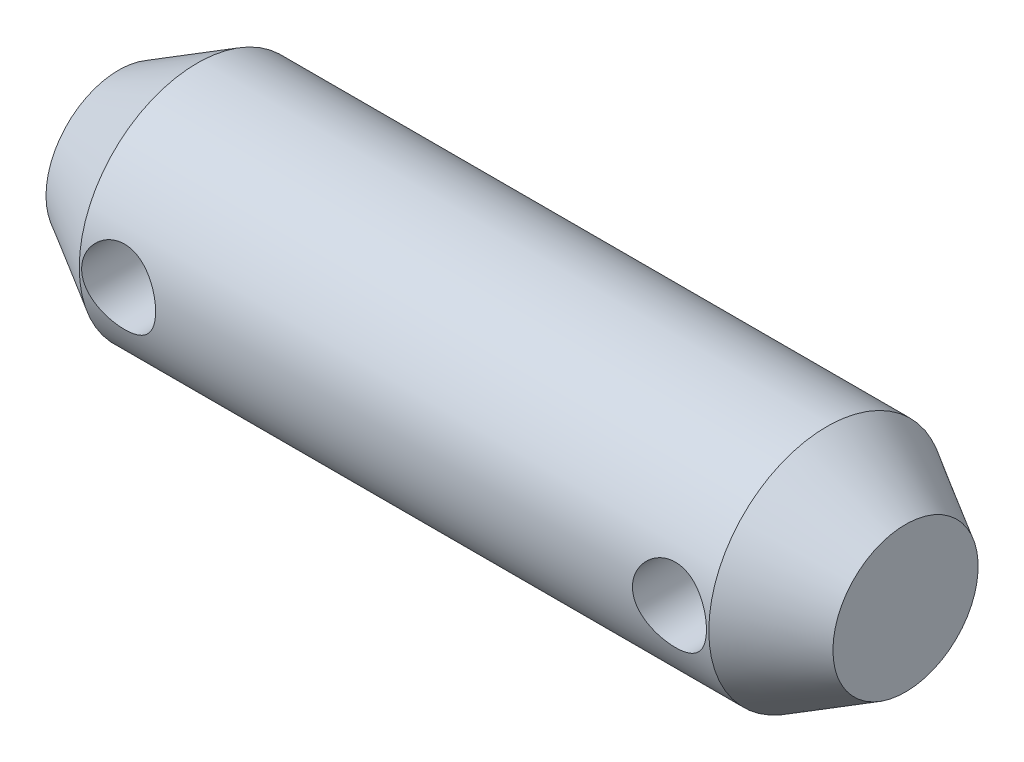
from build123d import *

# Parameters (mm, degrees)
HOLE_DEPTH      = 11.22252415
HOLE_DEPTH_BACK = 11.22252415
SKETCH2_R       = 0.47


with BuildPart() as part:
    # Sketch1 → Base-Revolve (revolve)
    with BuildSketch(Plane.XY, mode=Mode.PRIVATE) as base_revolve_sk:
        Polygon((10, 0), (10, 0.922649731), (9, 1.5), (1, 1.5), (0, 0.922649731), (0, 0), align=None)
    revolve(base_revolve_sk.sketch.rotate(Axis((-13.735799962, 0, 0), (1, 0, 0)), 90), axis=Axis((-13.735799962, 0, 0), (1, 0, 0)))

    # Sketch2 → Hole (cut, two sides: drawn at the far end of the back side and taken through both)
    with BuildSketch(Plane.XY.offset(-HOLE_DEPTH_BACK)):
        with Locations((8.5, 0)):
            Circle(SKETCH2_R)
        with Locations((1.5, 0)):
            Circle(SKETCH2_R)
    extrude(amount=HOLE_DEPTH + HOLE_DEPTH_BACK, mode=Mode.SUBTRACT)


solid = part.part
